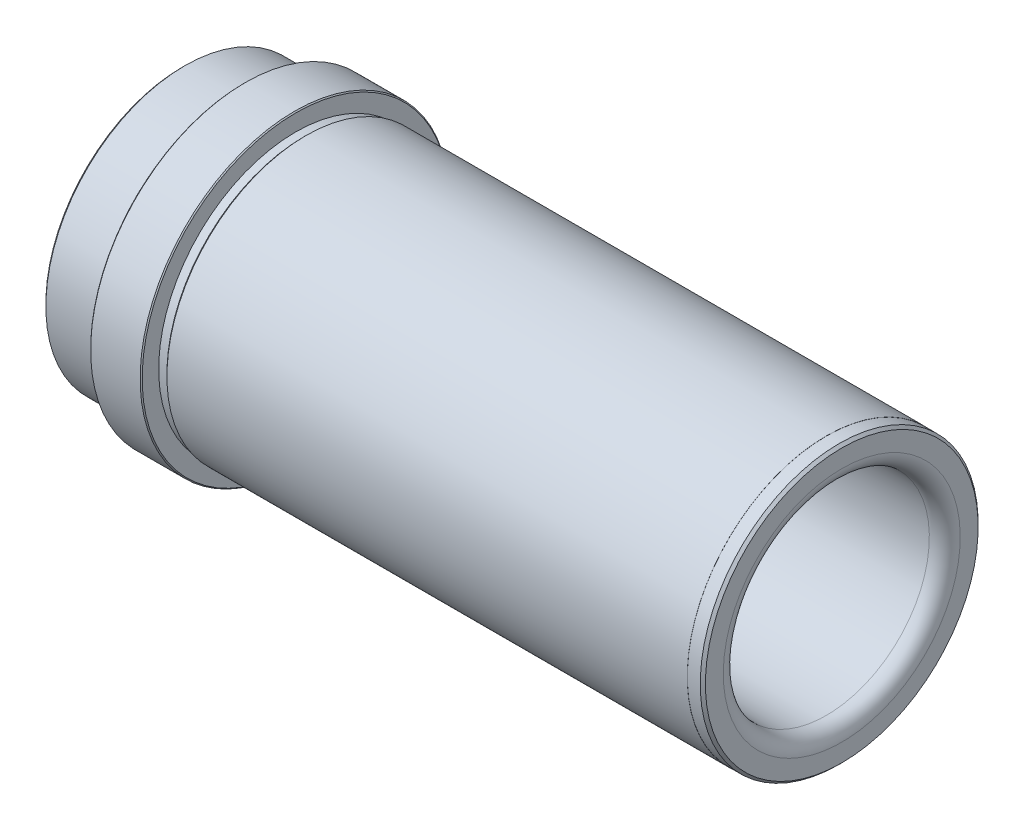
ISO-10303-21;
HEADER;
FILE_DESCRIPTION(('STEP AP214'),'2;1');
FILE_NAME('part.step','',(''),(''),'','','');
FILE_SCHEMA(('AUTOMOTIVE_DESIGN { 1 0 10303 214 1 1 1 1 }'));
ENDSEC;
DATA;
#1=APPLICATION_CONTEXT('core data for automotive mechanical design processes');
#2=APPLICATION_PROTOCOL_DEFINITION('international standard','automotive_design',2000,#1);
#3=PRODUCT_CONTEXT('',#1,'mechanical');
#4=PRODUCT('Part','Part','',(#3));
#5=PRODUCT_RELATED_PRODUCT_CATEGORY('part','',(#4));
#6=PRODUCT_DEFINITION_FORMATION('','',#4);
#7=PRODUCT_DEFINITION_CONTEXT('part definition',#1,'design');
#8=PRODUCT_DEFINITION('design','',#6,#7);
#9=PRODUCT_DEFINITION_SHAPE('','',#8);
#10=(LENGTH_UNIT() NAMED_UNIT(*) SI_UNIT(.MILLI.,.METRE.));
#11=(NAMED_UNIT(*) PLANE_ANGLE_UNIT() SI_UNIT($,.RADIAN.));
#12=(NAMED_UNIT(*) SI_UNIT($,.STERADIAN.) SOLID_ANGLE_UNIT());
#13=UNCERTAINTY_MEASURE_WITH_UNIT(LENGTH_MEASURE(1.E-05),#10,'distance_accuracy_value','');
#14=(GEOMETRIC_REPRESENTATION_CONTEXT(3) GLOBAL_UNCERTAINTY_ASSIGNED_CONTEXT((#13)) GLOBAL_UNIT_ASSIGNED_CONTEXT((#10,
#11,#12)) REPRESENTATION_CONTEXT('',''));
#15=CARTESIAN_POINT('',(0.,0.,0.));
#16=DIRECTION('',(0.,0.,1.));
#17=DIRECTION('',(1.,0.,0.));
#18=AXIS2_PLACEMENT_3D('',#15,#16,#17);
#19=CARTESIAN_POINT('',(64.,0.,0.));
#20=DIRECTION('',(1.,0.,0.));
#21=DIRECTION('',(0.,1.,0.));
#22=AXIS2_PLACEMENT_3D('',#19,#20,#21);
#23=CYLINDRICAL_SURFACE('',#22,26.6);
#24=CARTESIAN_POINT('',(-42.,0.,0.));
#25=DIRECTION('',(1.,0.,0.));
#26=DIRECTION('',(0.,1.,0.));
#27=AXIS2_PLACEMENT_3D('',#24,#25,#26);
#28=CIRCLE('',#27,26.6);
#29=CARTESIAN_POINT('',(-42.,26.6,0.));
#30=VERTEX_POINT('',#29);
#31=EDGE_CURVE('E73',#30,#30,#28,.T.);
#32=ORIENTED_EDGE('',*,*,#31,.T.);
#33=EDGE_LOOP('',(#32));
#34=FACE_BOUND('',#33,.T.);
#35=CARTESIAN_POINT('',(-40.4,0.,0.));
#36=DIRECTION('',(1.,0.,0.));
#37=DIRECTION('',(0.,1.,0.));
#38=AXIS2_PLACEMENT_3D('',#35,#36,#37);
#39=CIRCLE('',#38,26.6);
#40=CARTESIAN_POINT('',(-40.4,26.6,0.));
#41=VERTEX_POINT('',#40);
#42=EDGE_CURVE('E300',#41,#41,#39,.T.);
#43=ORIENTED_EDGE('',*,*,#42,.F.);
#44=EDGE_LOOP('',(#43));
#45=FACE_BOUND('',#44,.T.);
#46=ADVANCED_FACE('F29',(#34,#45),#23,.T.);
#47=CARTESIAN_POINT('',(-42.,30.,0.));
#48=DIRECTION('',(1.,0.,0.));
#49=DIRECTION('',(0.,1.,0.));
#50=AXIS2_PLACEMENT_3D('',#47,#48,#49);
#51=PLANE('',#50);
#52=CARTESIAN_POINT('',(-42.,0.,0.));
#53=DIRECTION('',(1.,0.,0.));
#54=DIRECTION('',(0.,1.,0.));
#55=AXIS2_PLACEMENT_3D('',#52,#53,#54);
#56=CIRCLE('',#55,29.7999999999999);
#57=CARTESIAN_POINT('',(-42.,29.7999999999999,0.));
#58=VERTEX_POINT('',#57);
#59=EDGE_CURVE('E49',#58,#58,#56,.T.);
#60=ORIENTED_EDGE('',*,*,#59,.T.);
#61=EDGE_LOOP('',(#60));
#62=FACE_BOUND('',#61,.T.);
#63=ORIENTED_EDGE('',*,*,#31,.F.);
#64=EDGE_LOOP('',(#63));
#65=FACE_BOUND('',#64,.T.);
#66=ADVANCED_FACE('F135',(#62,#65),#51,.T.);
#67=CARTESIAN_POINT('',(64.,0.,0.));
#68=DIRECTION('',(1.,0.,0.));
#69=DIRECTION('',(0.,1.,0.));
#70=AXIS2_PLACEMENT_3D('',#67,#68,#69);
#71=CYLINDRICAL_SURFACE('',#70,30.);
#72=CARTESIAN_POINT('',(-51.8,0.,0.));
#73=DIRECTION('',(-1.,0.,0.));
#74=DIRECTION('',(0.,-1.,0.));
#75=AXIS2_PLACEMENT_3D('',#72,#73,#74);
#76=CIRCLE('',#75,30.);
#77=CARTESIAN_POINT('',(-51.8,-30.,0.));
#78=VERTEX_POINT('',#77);
#79=EDGE_CURVE('E55',#78,#78,#76,.F.);
#80=ORIENTED_EDGE('',*,*,#79,.T.);
#81=EDGE_LOOP('',(#80));
#82=FACE_BOUND('',#81,.T.);
#83=CARTESIAN_POINT('',(-42.2,0.,0.));
#84=DIRECTION('',(1.,0.,0.));
#85=DIRECTION('',(0.,1.,0.));
#86=AXIS2_PLACEMENT_3D('',#83,#84,#85);
#87=CIRCLE('',#86,30.);
#88=CARTESIAN_POINT('',(-42.2000000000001,30.,0.));
#89=VERTEX_POINT('',#88);
#90=EDGE_CURVE('E58',#89,#89,#87,.F.);
#91=ORIENTED_EDGE('',*,*,#90,.T.);
#92=EDGE_LOOP('',(#91));
#93=FACE_BOUND('',#92,.T.);
#94=ADVANCED_FACE('F131',(#82,#93),#71,.T.);
#95=CARTESIAN_POINT('',(-52.,26.6,0.));
#96=DIRECTION('',(-1.,0.,0.));
#97=DIRECTION('',(0.,-1.,0.));
#98=AXIS2_PLACEMENT_3D('',#95,#96,#97);
#99=PLANE('',#98);
#100=CARTESIAN_POINT('',(-52.,0.,0.));
#101=DIRECTION('',(-1.,0.,0.));
#102=DIRECTION('',(0.,-1.,0.));
#103=AXIS2_PLACEMENT_3D('',#100,#101,#102);
#104=CIRCLE('',#103,29.8);
#105=CARTESIAN_POINT('',(-52.,-29.8,0.));
#106=VERTEX_POINT('',#105);
#107=EDGE_CURVE('E52',#106,#106,#104,.T.);
#108=ORIENTED_EDGE('',*,*,#107,.T.);
#109=EDGE_LOOP('',(#108));
#110=FACE_BOUND('',#109,.T.);
#111=CARTESIAN_POINT('',(-52.,0.,0.));
#112=DIRECTION('',(1.,0.,0.));
#113=DIRECTION('',(0.,1.,0.));
#114=AXIS2_PLACEMENT_3D('',#111,#112,#113);
#115=CIRCLE('',#114,26.6);
#116=CARTESIAN_POINT('',(-52.,26.6,0.));
#117=VERTEX_POINT('',#116);
#118=EDGE_CURVE('E327',#117,#117,#115,.T.);
#119=ORIENTED_EDGE('',*,*,#118,.T.);
#120=EDGE_LOOP('',(#119));
#121=FACE_BOUND('',#120,.T.);
#122=ADVANCED_FACE('F127',(#110,#121),#99,.T.);
#123=CARTESIAN_POINT('',(64.,0.,0.));
#124=DIRECTION('',(1.,0.,0.));
#125=DIRECTION('',(0.,1.,0.));
#126=AXIS2_PLACEMENT_3D('',#123,#124,#125);
#127=CYLINDRICAL_SURFACE('',#126,26.6);
#128=CARTESIAN_POINT('',(-53.6,0.,0.));
#129=DIRECTION('',(1.,0.,0.));
#130=DIRECTION('',(0.,1.,0.));
#131=AXIS2_PLACEMENT_3D('',#128,#129,#130);
#132=CIRCLE('',#131,26.6);
#133=CARTESIAN_POINT('',(-53.6,26.6,0.));
#134=VERTEX_POINT('',#133);
#135=EDGE_CURVE('E324',#134,#134,#132,.T.);
#136=ORIENTED_EDGE('',*,*,#135,.T.);
#137=EDGE_LOOP('',(#136));
#138=FACE_BOUND('',#137,.T.);
#139=ORIENTED_EDGE('',*,*,#118,.F.);
#140=EDGE_LOOP('',(#139));
#141=FACE_BOUND('',#140,.T.);
#142=ADVANCED_FACE('F123',(#138,#141),#127,.T.);
#143=CARTESIAN_POINT('',(-53.6,0.,0.));
#144=DIRECTION('',(-1.,0.,0.));
#145=DIRECTION('',(0.,-1.,0.));
#146=AXIS2_PLACEMENT_3D('',#143,#144,#145);
#147=CONICAL_SURFACE('',#146,26.6,0.785398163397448);
#148=CARTESIAN_POINT('',(-54.,0.,0.));
#149=DIRECTION('',(1.,0.,0.));
#150=DIRECTION('',(0.,1.,0.));
#151=AXIS2_PLACEMENT_3D('',#148,#149,#150);
#152=CIRCLE('',#151,27.);
#153=CARTESIAN_POINT('',(-54.,27.,0.));
#154=VERTEX_POINT('',#153);
#155=EDGE_CURVE('E321',#154,#154,#152,.T.);
#156=ORIENTED_EDGE('',*,*,#155,.T.);
#157=EDGE_LOOP('',(#156));
#158=FACE_BOUND('',#157,.T.);
#159=ORIENTED_EDGE('',*,*,#135,.F.);
#160=EDGE_LOOP('',(#159));
#161=FACE_BOUND('',#160,.T.);
#162=ADVANCED_FACE('F120',(#158,#161),#147,.T.);
#163=CARTESIAN_POINT('',(64.,0.,0.));
#164=DIRECTION('',(1.,0.,0.));
#165=DIRECTION('',(0.,1.,0.));
#166=AXIS2_PLACEMENT_3D('',#163,#164,#165);
#167=CYLINDRICAL_SURFACE('',#166,27.);
#168=CARTESIAN_POINT('',(-63.5,0.,0.));
#169=DIRECTION('',(-1.,0.,0.));
#170=DIRECTION('',(0.,-1.,0.));
#171=AXIS2_PLACEMENT_3D('',#168,#169,#170);
#172=CIRCLE('',#171,27.);
#173=CARTESIAN_POINT('',(-63.5,-27.,0.));
#174=VERTEX_POINT('',#173);
#175=EDGE_CURVE('E11',#174,#174,#172,.F.);
#176=ORIENTED_EDGE('',*,*,#175,.T.);
#177=EDGE_LOOP('',(#176));
#178=FACE_BOUND('',#177,.T.);
#179=ORIENTED_EDGE('',*,*,#155,.F.);
#180=EDGE_LOOP('',(#179));
#181=FACE_BOUND('',#180,.T.);
#182=ADVANCED_FACE('F116',(#178,#181),#167,.T.);
#183=CARTESIAN_POINT('',(-64.,27.,0.));
#184=DIRECTION('',(-1.,0.,0.));
#185=DIRECTION('',(0.,-1.,0.));
#186=AXIS2_PLACEMENT_3D('',#183,#184,#185);
#187=PLANE('',#186);
#188=CARTESIAN_POINT('',(-64.,0.,0.));
#189=DIRECTION('',(-1.,0.,0.));
#190=DIRECTION('',(0.,-1.,0.));
#191=AXIS2_PLACEMENT_3D('',#188,#189,#190);
#192=CIRCLE('',#191,20.51);
#193=CARTESIAN_POINT('',(-64.,-20.51,0.));
#194=VERTEX_POINT('',#193);
#195=EDGE_CURVE('E40',#194,#194,#192,.F.);
#196=ORIENTED_EDGE('',*,*,#195,.T.);
#197=EDGE_LOOP('',(#196));
#198=FACE_BOUND('',#197,.T.);
#199=CARTESIAN_POINT('',(-64.,0.,0.));
#200=DIRECTION('',(-1.,0.,0.));
#201=DIRECTION('',(0.,-1.,0.));
#202=AXIS2_PLACEMENT_3D('',#199,#200,#201);
#203=CIRCLE('',#202,26.5);
#204=CARTESIAN_POINT('',(-64.,-26.5,0.));
#205=VERTEX_POINT('',#204);
#206=EDGE_CURVE('E44',#205,#205,#203,.T.);
#207=ORIENTED_EDGE('',*,*,#206,.T.);
#208=EDGE_LOOP('',(#207));
#209=FACE_BOUND('',#208,.T.);
#210=ADVANCED_FACE('F112',(#198,#209),#187,.T.);
#211=CARTESIAN_POINT('',(64.,26.975,0.));
#212=DIRECTION('',(1.,0.,0.));
#213=DIRECTION('',(0.,1.,0.));
#214=AXIS2_PLACEMENT_3D('',#211,#212,#213);
#215=PLANE('',#214);
#216=CARTESIAN_POINT('',(64.,0.,0.));
#217=DIRECTION('',(1.,0.,0.));
#218=DIRECTION('',(0.,1.,0.));
#219=AXIS2_PLACEMENT_3D('',#216,#217,#218);
#220=CIRCLE('',#219,26.475);
#221=CARTESIAN_POINT('',(64.,26.475,0.));
#222=VERTEX_POINT('',#221);
#223=EDGE_CURVE('E64',#222,#222,#220,.T.);
#224=ORIENTED_EDGE('',*,*,#223,.T.);
#225=EDGE_LOOP('',(#224));
#226=FACE_BOUND('',#225,.T.);
#227=CARTESIAN_POINT('',(64.,0.,0.));
#228=DIRECTION('',(1.,0.,0.));
#229=DIRECTION('',(0.,1.,0.));
#230=AXIS2_PLACEMENT_3D('',#227,#228,#229);
#231=CIRCLE('',#230,23.);
#232=CARTESIAN_POINT('',(64.,23.,0.));
#233=VERTEX_POINT('',#232);
#234=EDGE_CURVE('E67',#233,#233,#231,.F.);
#235=ORIENTED_EDGE('',*,*,#234,.T.);
#236=EDGE_LOOP('',(#235));
#237=FACE_BOUND('',#236,.T.);
#238=ADVANCED_FACE('F108',(#226,#237),#215,.T.);
#239=CARTESIAN_POINT('',(64.,0.,0.));
#240=DIRECTION('',(1.,0.,0.));
#241=DIRECTION('',(0.,1.,0.));
#242=AXIS2_PLACEMENT_3D('',#239,#240,#241);
#243=CYLINDRICAL_SURFACE('',#242,26.975);
#244=CARTESIAN_POINT('',(63.5,0.,0.));
#245=DIRECTION('',(1.,0.,0.));
#246=DIRECTION('',(0.,1.,0.));
#247=AXIS2_PLACEMENT_3D('',#244,#245,#246);
#248=CIRCLE('',#247,26.975);
#249=CARTESIAN_POINT('',(63.5,26.975,0.));
#250=VERTEX_POINT('',#249);
#251=EDGE_CURVE('E61',#250,#250,#248,.F.);
#252=ORIENTED_EDGE('',*,*,#251,.T.);
#253=EDGE_LOOP('',(#252));
#254=FACE_BOUND('',#253,.T.);
#255=CARTESIAN_POINT('',(61.,0.,0.));
#256=DIRECTION('',(1.,0.,0.));
#257=DIRECTION('',(0.,1.,0.));
#258=AXIS2_PLACEMENT_3D('',#255,#256,#257);
#259=CIRCLE('',#258,26.975);
#260=CARTESIAN_POINT('',(61.,26.975,0.));
#261=VERTEX_POINT('',#260);
#262=EDGE_CURVE('E318',#261,#261,#259,.T.);
#263=ORIENTED_EDGE('',*,*,#262,.T.);
#264=EDGE_LOOP('',(#263));
#265=FACE_BOUND('',#264,.T.);
#266=ADVANCED_FACE('F104',(#254,#265),#243,.T.);
#267=CARTESIAN_POINT('',(61.,26.975,0.));
#268=DIRECTION('',(1.,0.,0.));
#269=DIRECTION('',(0.,1.,0.));
#270=AXIS2_PLACEMENT_3D('',#267,#268,#269);
#271=PLANE('',#270);
#272=CARTESIAN_POINT('',(61.,0.,0.));
#273=DIRECTION('',(1.,0.,0.));
#274=DIRECTION('',(0.,1.,0.));
#275=AXIS2_PLACEMENT_3D('',#272,#273,#274);
#276=CIRCLE('',#275,27.);
#277=CARTESIAN_POINT('',(61.,27.,0.));
#278=VERTEX_POINT('',#277);
#279=EDGE_CURVE('E315',#278,#278,#276,.T.);
#280=ORIENTED_EDGE('',*,*,#279,.T.);
#281=EDGE_LOOP('',(#280));
#282=FACE_BOUND('',#281,.T.);
#283=ORIENTED_EDGE('',*,*,#262,.F.);
#284=EDGE_LOOP('',(#283));
#285=FACE_BOUND('',#284,.T.);
#286=ADVANCED_FACE('F100',(#282,#285),#271,.T.);
#287=CARTESIAN_POINT('',(64.,0.,0.));
#288=DIRECTION('',(1.,0.,0.));
#289=DIRECTION('',(0.,1.,0.));
#290=AXIS2_PLACEMENT_3D('',#287,#288,#289);
#291=CYLINDRICAL_SURFACE('',#290,27.);
#292=CARTESIAN_POINT('',(-40.,0.,0.));
#293=DIRECTION('',(1.,0.,0.));
#294=DIRECTION('',(0.,1.,0.));
#295=AXIS2_PLACEMENT_3D('',#292,#293,#294);
#296=CIRCLE('',#295,27.);
#297=CARTESIAN_POINT('',(-40.,27.,0.));
#298=VERTEX_POINT('',#297);
#299=EDGE_CURVE('E312',#298,#298,#296,.T.);
#300=ORIENTED_EDGE('',*,*,#299,.T.);
#301=EDGE_LOOP('',(#300));
#302=FACE_BOUND('',#301,.T.);
#303=ORIENTED_EDGE('',*,*,#279,.F.);
#304=EDGE_LOOP('',(#303));
#305=FACE_BOUND('',#304,.T.);
#306=ADVANCED_FACE('F96',(#302,#305),#291,.T.);
#307=CARTESIAN_POINT('',(-40.,0.,0.));
#308=DIRECTION('',(1.,0.,0.));
#309=DIRECTION('',(0.,1.,0.));
#310=AXIS2_PLACEMENT_3D('',#307,#308,#309);
#311=CONICAL_SURFACE('',#310,27.,0.785398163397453);
#312=ORIENTED_EDGE('',*,*,#42,.T.);
#313=EDGE_LOOP('',(#312));
#314=FACE_BOUND('',#313,.T.);
#315=ORIENTED_EDGE('',*,*,#299,.F.);
#316=EDGE_LOOP('',(#315));
#317=FACE_BOUND('',#316,.T.);
#318=ADVANCED_FACE('F91',(#314,#317),#311,.T.);
#319=CARTESIAN_POINT('',(-52.,0.,0.));
#320=DIRECTION('',(1.,0.,0.));
#321=DIRECTION('',(0.,1.,0.));
#322=AXIS2_PLACEMENT_3D('',#319,#320,#321);
#323=CYLINDRICAL_SURFACE('',#322,20.);
#324=CARTESIAN_POINT('',(61.,0.,0.));
#325=DIRECTION('',(1.,0.,0.));
#326=DIRECTION('',(0.,1.,0.));
#327=AXIS2_PLACEMENT_3D('',#324,#325,#326);
#328=CIRCLE('',#327,20.);
#329=CARTESIAN_POINT('',(61.,20.,0.));
#330=VERTEX_POINT('',#329);
#331=EDGE_CURVE('E70',#330,#330,#328,.T.);
#332=ORIENTED_EDGE('',*,*,#331,.T.);
#333=EDGE_LOOP('',(#332));
#334=FACE_BOUND('',#333,.T.);
#335=CARTESIAN_POINT('',(-52.,0.,0.));
#336=DIRECTION('',(1.,0.,0.));
#337=DIRECTION('',(0.,1.,0.));
#338=AXIS2_PLACEMENT_3D('',#335,#336,#337);
#339=CIRCLE('',#338,20.01);
#340=CARTESIAN_POINT('',(-52.,20.01,0.));
#341=VERTEX_POINT('',#340);
#342=EDGE_CURVE('E297',#341,#341,#339,.T.);
#343=ORIENTED_EDGE('',*,*,#342,.F.);
#344=EDGE_LOOP('',(#343));
#345=FACE_BOUND('',#344,.T.);
#346=ADVANCED_FACE('F80',(#334,#345),#323,.F.);
#347=CARTESIAN_POINT('',(-64.,0.,0.));
#348=DIRECTION('',(1.,0.,0.));
#349=DIRECTION('',(0.,1.,0.));
#350=AXIS2_PLACEMENT_3D('',#347,#348,#349);
#351=CYLINDRICAL_SURFACE('',#350,20.01);
#352=CARTESIAN_POINT('',(-63.5,0.,0.));
#353=DIRECTION('',(-1.,0.,0.));
#354=DIRECTION('',(0.,-1.,0.));
#355=AXIS2_PLACEMENT_3D('',#352,#353,#354);
#356=CIRCLE('',#355,20.01);
#357=CARTESIAN_POINT('',(-63.5,-20.01,0.));
#358=VERTEX_POINT('',#357);
#359=EDGE_CURVE('E36',#358,#358,#356,.T.);
#360=ORIENTED_EDGE('',*,*,#359,.T.);
#361=EDGE_LOOP('',(#360));
#362=FACE_BOUND('',#361,.T.);
#363=ORIENTED_EDGE('',*,*,#342,.T.);
#364=EDGE_LOOP('',(#363));
#365=FACE_BOUND('',#364,.T.);
#366=ADVANCED_FACE('F90',(#362,#365),#351,.F.);
#367=CARTESIAN_POINT('',(61.,0.,0.));
#368=DIRECTION('',(1.,0.,0.));
#369=DIRECTION('',(0.,1.,0.));
#370=AXIS2_PLACEMENT_3D('',#367,#368,#369);
#371=TOROIDAL_SURFACE('',#370,23.,3.);
#372=ORIENTED_EDGE('',*,*,#234,.F.);
#373=EDGE_LOOP('',(#372));
#374=FACE_BOUND('',#373,.T.);
#375=ORIENTED_EDGE('',*,*,#331,.F.);
#376=EDGE_LOOP('',(#375));
#377=FACE_BOUND('',#376,.T.);
#378=ADVANCED_FACE('F143',(#374,#377),#371,.T.);
#379=CARTESIAN_POINT('',(64.,0.,0.));
#380=DIRECTION('',(-1.,0.,0.));
#381=DIRECTION('',(0.,-1.,0.));
#382=AXIS2_PLACEMENT_3D('',#379,#380,#381);
#383=CONICAL_SURFACE('',#382,26.475,0.785398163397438);
#384=ORIENTED_EDGE('',*,*,#251,.F.);
#385=EDGE_LOOP('',(#384));
#386=FACE_BOUND('',#385,.T.);
#387=ORIENTED_EDGE('',*,*,#223,.F.);
#388=EDGE_LOOP('',(#387));
#389=FACE_BOUND('',#388,.T.);
#390=ADVANCED_FACE('F146',(#386,#389),#383,.T.);
#391=CARTESIAN_POINT('',(-51.8,0.,0.));
#392=DIRECTION('',(1.,0.,0.));
#393=DIRECTION('',(0.,1.,0.));
#394=AXIS2_PLACEMENT_3D('',#391,#392,#393);
#395=CONICAL_SURFACE('',#394,30.,0.785398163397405);
#396=ORIENTED_EDGE('',*,*,#107,.F.);
#397=EDGE_LOOP('',(#396));
#398=FACE_BOUND('',#397,.T.);
#399=ORIENTED_EDGE('',*,*,#79,.F.);
#400=EDGE_LOOP('',(#399));
#401=FACE_BOUND('',#400,.T.);
#402=ADVANCED_FACE('F150',(#398,#401),#395,.T.);
#403=CARTESIAN_POINT('',(-42.,0.,0.));
#404=DIRECTION('',(-1.,0.,0.));
#405=DIRECTION('',(0.,-1.,0.));
#406=AXIS2_PLACEMENT_3D('',#403,#404,#405);
#407=CONICAL_SURFACE('',#406,29.7999999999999,0.785398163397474);
#408=ORIENTED_EDGE('',*,*,#90,.F.);
#409=EDGE_LOOP('',(#408));
#410=FACE_BOUND('',#409,.T.);
#411=ORIENTED_EDGE('',*,*,#59,.F.);
#412=EDGE_LOOP('',(#411));
#413=FACE_BOUND('',#412,.T.);
#414=ADVANCED_FACE('F154',(#410,#413),#407,.T.);
#415=CARTESIAN_POINT('',(-64.,0.,0.));
#416=DIRECTION('',(-1.,0.,0.));
#417=DIRECTION('',(0.,-1.,0.));
#418=AXIS2_PLACEMENT_3D('',#415,#416,#417);
#419=CONICAL_SURFACE('',#418,20.51,0.785398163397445);
#420=ORIENTED_EDGE('',*,*,#359,.F.);
#421=EDGE_LOOP('',(#420));
#422=FACE_BOUND('',#421,.T.);
#423=ORIENTED_EDGE('',*,*,#195,.F.);
#424=EDGE_LOOP('',(#423));
#425=FACE_BOUND('',#424,.T.);
#426=ADVANCED_FACE('F157',(#422,#425),#419,.F.);
#427=CARTESIAN_POINT('',(-63.5,0.,0.));
#428=DIRECTION('',(1.,0.,0.));
#429=DIRECTION('',(0.,1.,0.));
#430=AXIS2_PLACEMENT_3D('',#427,#428,#429);
#431=CONICAL_SURFACE('',#430,27.,0.785398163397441);
#432=ORIENTED_EDGE('',*,*,#206,.F.);
#433=EDGE_LOOP('',(#432));
#434=FACE_BOUND('',#433,.T.);
#435=ORIENTED_EDGE('',*,*,#175,.F.);
#436=EDGE_LOOP('',(#435));
#437=FACE_BOUND('',#436,.T.);
#438=ADVANCED_FACE('F31',(#434,#437),#431,.T.);
#439=CLOSED_SHELL('',(#46,#66,#94,#122,#142,#162,#182,#210,#238,#266,#286,#306,#318,#346,#366,
#378,#390,#402,#414,#426,#438));
#440=MANIFOLD_SOLID_BREP('B2',#439);
#441=ADVANCED_BREP_SHAPE_REPRESENTATION('',(#18,#440),#14);
#442=SHAPE_DEFINITION_REPRESENTATION(#9,#441);
ENDSEC;
END-ISO-10303-21;
